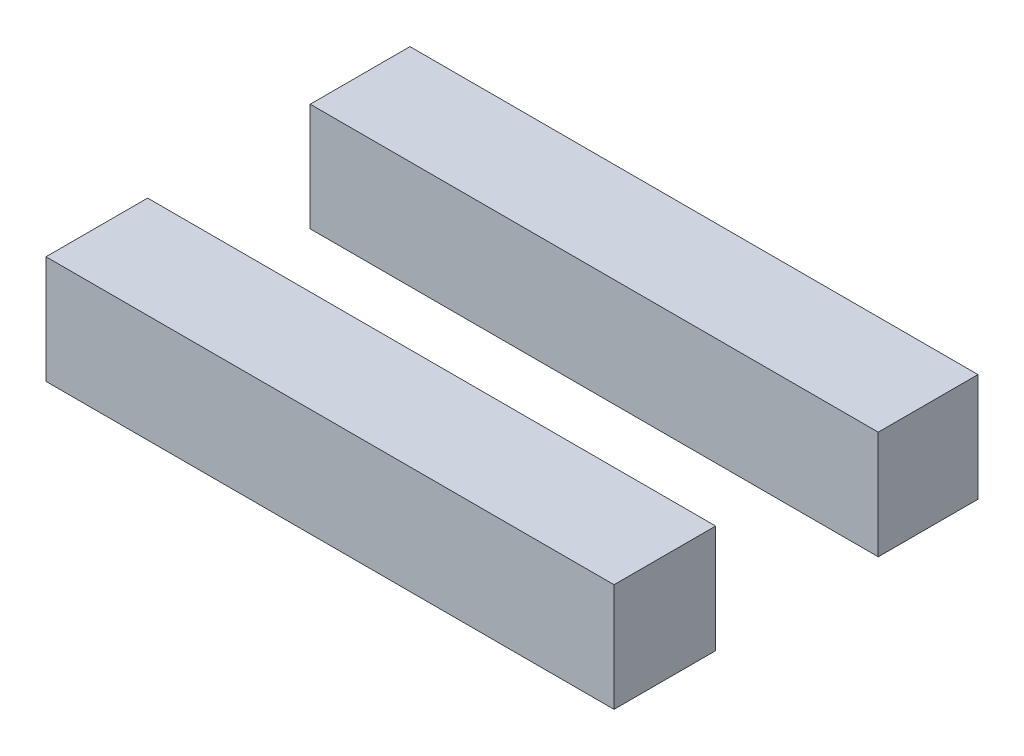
from build123d import *

# Parameters (mm, degrees)
SKETCH1_W          = 173.591221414
SKETCH1_H          = 111.229315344
EXTRUDE1_DEPTH     = 33
SKETCH3_W          = 189.616296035
SKETCH3_H          = 49.688607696
CUT_EXTRUDE1_DEPTH = 109.238016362


with BuildPart() as part:
    # Sketch1 → Extrude1 (new body)
    with BuildSketch(Plane(origin=(0, 0, 0), x_dir=(1, 0, 0), z_dir=(0, 1, 0))):
        Rectangle(SKETCH1_W, SKETCH1_H)
    extrude(amount=EXTRUDE1_DEPTH)

    # Sketch3 → Cut-Extrude1 (cut, through all)
    with BuildSketch(Plane(origin=(0, 33, 0), x_dir=(-1, 0, 0), z_dir=(0, 1, 0))):
        with Locations((-0.571133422, -0.285566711)):
            Rectangle(SKETCH3_W, SKETCH3_H)
    extrude(amount=-CUT_EXTRUDE1_DEPTH, mode=Mode.SUBTRACT)


with BuildPart() as cut_extrude1_piece_1:
    # of the separate pieces the step leaves, piece 1, a body of its own (cut_extrude1_pieces)
    add(part.part.solids().sort_by_distance((-86.795610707, 0, 55.614657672))[0])


with BuildPart() as cut_extrude1_piece_2:
    # of the separate pieces the step leaves, piece 2, a body of its own (cut_extrude1_pieces)
    add(part.part.solids().sort_by_distance((-86.795610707, 0, -55.614657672))[0])


solid = Compound([cut_extrude1_piece_1.part, cut_extrude1_piece_2.part])
